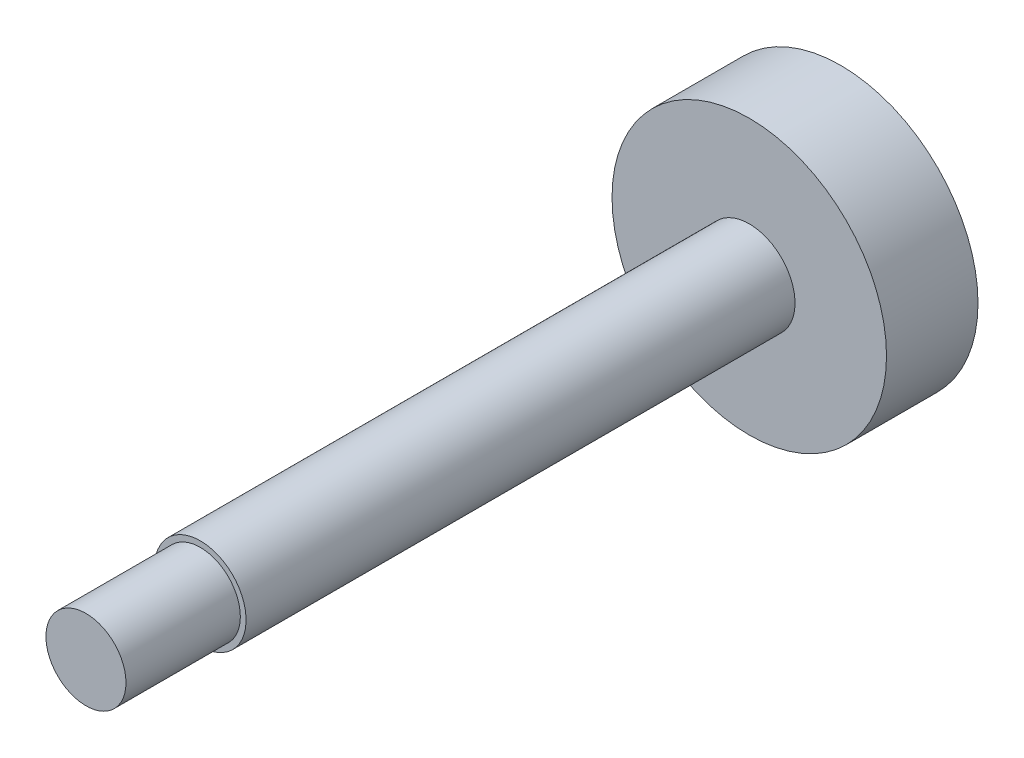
ISO-10303-21;
HEADER;
FILE_DESCRIPTION(('STEP AP214'),'2;1');
FILE_NAME('part.step','',(''),(''),'','','');
FILE_SCHEMA(('AUTOMOTIVE_DESIGN { 1 0 10303 214 1 1 1 1 }'));
ENDSEC;
DATA;
#1=APPLICATION_CONTEXT('core data for automotive mechanical design processes');
#2=APPLICATION_PROTOCOL_DEFINITION('international standard','automotive_design',2000,#1);
#3=PRODUCT_CONTEXT('',#1,'mechanical');
#4=PRODUCT('Part','Part','',(#3));
#5=PRODUCT_RELATED_PRODUCT_CATEGORY('part','',(#4));
#6=PRODUCT_DEFINITION_FORMATION('','',#4);
#7=PRODUCT_DEFINITION_CONTEXT('part definition',#1,'design');
#8=PRODUCT_DEFINITION('design','',#6,#7);
#9=PRODUCT_DEFINITION_SHAPE('','',#8);
#10=(LENGTH_UNIT() NAMED_UNIT(*) SI_UNIT(.MILLI.,.METRE.));
#11=(NAMED_UNIT(*) PLANE_ANGLE_UNIT() SI_UNIT($,.RADIAN.));
#12=(NAMED_UNIT(*) SI_UNIT($,.STERADIAN.) SOLID_ANGLE_UNIT());
#13=UNCERTAINTY_MEASURE_WITH_UNIT(LENGTH_MEASURE(1.E-05),#10,'distance_accuracy_value','');
#14=(GEOMETRIC_REPRESENTATION_CONTEXT(3) GLOBAL_UNCERTAINTY_ASSIGNED_CONTEXT((#13)) GLOBAL_UNIT_ASSIGNED_CONTEXT((#10,
#11,#12)) REPRESENTATION_CONTEXT('',''));
#15=CARTESIAN_POINT('',(0.,0.,0.));
#16=DIRECTION('',(0.,0.,1.));
#17=DIRECTION('',(1.,0.,0.));
#18=AXIS2_PLACEMENT_3D('',#15,#16,#17);
#19=CARTESIAN_POINT('',(0.,0.,177.8));
#20=DIRECTION('',(0.,0.,1.));
#21=DIRECTION('',(1.,0.,0.));
#22=AXIS2_PLACEMENT_3D('',#19,#20,#21);
#23=PLANE('',#22);
#24=CARTESIAN_POINT('',(0.,0.,177.8));
#25=DIRECTION('',(0.,0.,1.));
#26=DIRECTION('',(1.,0.,0.));
#27=AXIS2_PLACEMENT_3D('',#24,#25,#26);
#28=CIRCLE('',#27,12.7);
#29=CARTESIAN_POINT('',(-12.7,0.,177.8));
#30=VERTEX_POINT('',#29);
#31=EDGE_CURVE('E39',#30,#30,#28,.T.);
#32=ORIENTED_EDGE('',*,*,#31,.T.);
#33=EDGE_LOOP('',(#32));
#34=FACE_BOUND('',#33,.T.);
#35=CARTESIAN_POINT('',(0.,0.,177.8));
#36=DIRECTION('',(0.,0.,1.));
#37=DIRECTION('',(1.,0.,0.));
#38=AXIS2_PLACEMENT_3D('',#35,#36,#37);
#39=CIRCLE('',#38,11.1125);
#40=CARTESIAN_POINT('',(11.1125,0.,177.8));
#41=VERTEX_POINT('',#40);
#42=EDGE_CURVE('E47',#41,#41,#39,.T.);
#43=ORIENTED_EDGE('',*,*,#42,.F.);
#44=EDGE_LOOP('',(#43));
#45=FACE_BOUND('',#44,.T.);
#46=ADVANCED_FACE('F28',(#34,#45),#23,.T.);
#47=CARTESIAN_POINT('',(0.,0.,25.4));
#48=DIRECTION('',(0.,0.,1.));
#49=DIRECTION('',(1.,0.,0.));
#50=AXIS2_PLACEMENT_3D('',#47,#48,#49);
#51=PLANE('',#50);
#52=CARTESIAN_POINT('',(0.,0.,25.4));
#53=DIRECTION('',(0.,0.,1.));
#54=DIRECTION('',(1.,0.,0.));
#55=AXIS2_PLACEMENT_3D('',#52,#53,#54);
#56=CIRCLE('',#55,38.1);
#57=CARTESIAN_POINT('',(38.1,0.,25.4));
#58=VERTEX_POINT('',#57);
#59=EDGE_CURVE('E10',#58,#58,#56,.T.);
#60=ORIENTED_EDGE('',*,*,#59,.T.);
#61=EDGE_LOOP('',(#60));
#62=FACE_BOUND('',#61,.T.);
#63=CARTESIAN_POINT('',(0.,0.,25.4));
#64=DIRECTION('',(0.,0.,1.));
#65=DIRECTION('',(1.,0.,0.));
#66=AXIS2_PLACEMENT_3D('',#63,#64,#65);
#67=CIRCLE('',#66,12.7);
#68=CARTESIAN_POINT('',(-12.7,0.,25.4));
#69=VERTEX_POINT('',#68);
#70=EDGE_CURVE('E41',#69,#69,#67,.T.);
#71=ORIENTED_EDGE('',*,*,#70,.F.);
#72=EDGE_LOOP('',(#71));
#73=FACE_BOUND('',#72,.T.);
#74=ADVANCED_FACE('F63',(#62,#73),#51,.T.);
#75=CARTESIAN_POINT('',(0.,0.,25.4));
#76=DIRECTION('',(0.,0.,-1.));
#77=DIRECTION('',(-1.,0.,0.));
#78=AXIS2_PLACEMENT_3D('',#75,#76,#77);
#79=CYLINDRICAL_SURFACE('',#78,38.1);
#80=ORIENTED_EDGE('',*,*,#59,.F.);
#81=EDGE_LOOP('',(#80));
#82=FACE_BOUND('',#81,.T.);
#83=CARTESIAN_POINT('',(0.,0.,0.));
#84=DIRECTION('',(0.,0.,1.));
#85=DIRECTION('',(1.,0.,0.));
#86=AXIS2_PLACEMENT_3D('',#83,#84,#85);
#87=CIRCLE('',#86,38.1);
#88=CARTESIAN_POINT('',(38.1,0.,0.));
#89=VERTEX_POINT('',#88);
#90=EDGE_CURVE('E32',#89,#89,#87,.T.);
#91=ORIENTED_EDGE('',*,*,#90,.T.);
#92=EDGE_LOOP('',(#91));
#93=FACE_BOUND('',#92,.T.);
#94=ADVANCED_FACE('F30',(#82,#93),#79,.T.);
#95=CARTESIAN_POINT('',(0.,0.,0.));
#96=DIRECTION('',(0.,0.,1.));
#97=DIRECTION('',(1.,0.,0.));
#98=AXIS2_PLACEMENT_3D('',#95,#96,#97);
#99=PLANE('',#98);
#100=ORIENTED_EDGE('',*,*,#90,.F.);
#101=EDGE_LOOP('',(#100));
#102=FACE_BOUND('',#101,.T.);
#103=ADVANCED_FACE('F73',(#102),#99,.F.);
#104=CARTESIAN_POINT('',(0.,0.,177.8));
#105=DIRECTION('',(0.,0.,-1.));
#106=DIRECTION('',(-1.,0.,0.));
#107=AXIS2_PLACEMENT_3D('',#104,#105,#106);
#108=CYLINDRICAL_SURFACE('',#107,12.7);
#109=CARTESIAN_POINT('',(-12.7,0.,177.8));
#110=CARTESIAN_POINT('',(-12.7,0.,176.2125));
#111=CARTESIAN_POINT('',(-12.7,0.,174.625));
#112=CARTESIAN_POINT('',(-12.7,0.,171.45));
#113=CARTESIAN_POINT('',(-12.7,0.,169.8625));
#114=CARTESIAN_POINT('',(-12.7,0.,166.6875));
#115=CARTESIAN_POINT('',(-12.7,0.,165.1));
#116=CARTESIAN_POINT('',(-12.7,0.,161.925));
#117=CARTESIAN_POINT('',(-12.7,0.,160.3375));
#118=CARTESIAN_POINT('',(-12.7,0.,157.1625));
#119=CARTESIAN_POINT('',(-12.7,0.,155.575));
#120=CARTESIAN_POINT('',(-12.7,0.,152.4));
#121=CARTESIAN_POINT('',(-12.7,0.,150.8125));
#122=CARTESIAN_POINT('',(-12.7,0.,147.6375));
#123=CARTESIAN_POINT('',(-12.7,0.,146.05));
#124=CARTESIAN_POINT('',(-12.7,0.,142.875));
#125=CARTESIAN_POINT('',(-12.7,0.,141.2875));
#126=CARTESIAN_POINT('',(-12.7,0.,138.1125));
#127=CARTESIAN_POINT('',(-12.7,0.,136.525));
#128=CARTESIAN_POINT('',(-12.7,0.,133.35));
#129=CARTESIAN_POINT('',(-12.7,0.,131.7625));
#130=CARTESIAN_POINT('',(-12.7,0.,128.5875));
#131=CARTESIAN_POINT('',(-12.7,0.,127.));
#132=CARTESIAN_POINT('',(-12.7,0.,123.825));
#133=CARTESIAN_POINT('',(-12.7,0.,122.2375));
#134=CARTESIAN_POINT('',(-12.7,0.,119.0625));
#135=CARTESIAN_POINT('',(-12.7,0.,117.475));
#136=CARTESIAN_POINT('',(-12.7,0.,114.3));
#137=CARTESIAN_POINT('',(-12.7,0.,112.7125));
#138=CARTESIAN_POINT('',(-12.7,0.,109.5375));
#139=CARTESIAN_POINT('',(-12.7,0.,107.95));
#140=CARTESIAN_POINT('',(-12.7,0.,104.775));
#141=CARTESIAN_POINT('',(-12.7,0.,103.1875));
#142=CARTESIAN_POINT('',(-12.7,0.,100.0125));
#143=CARTESIAN_POINT('',(-12.7,0.,98.425));
#144=CARTESIAN_POINT('',(-12.7,0.,95.25));
#145=CARTESIAN_POINT('',(-12.7,0.,93.6625));
#146=CARTESIAN_POINT('',(-12.7,0.,90.4875));
#147=CARTESIAN_POINT('',(-12.7,0.,88.9));
#148=CARTESIAN_POINT('',(-12.7,0.,85.725));
#149=CARTESIAN_POINT('',(-12.7,0.,84.1375));
#150=CARTESIAN_POINT('',(-12.7,0.,80.9625));
#151=CARTESIAN_POINT('',(-12.7,0.,79.375));
#152=CARTESIAN_POINT('',(-12.7,0.,76.2));
#153=CARTESIAN_POINT('',(-12.7,0.,74.6125));
#154=CARTESIAN_POINT('',(-12.7,0.,71.4375));
#155=CARTESIAN_POINT('',(-12.7,0.,69.85));
#156=CARTESIAN_POINT('',(-12.7,0.,66.675));
#157=CARTESIAN_POINT('',(-12.7,0.,65.0875));
#158=CARTESIAN_POINT('',(-12.7,0.,61.9125));
#159=CARTESIAN_POINT('',(-12.7,0.,60.325));
#160=CARTESIAN_POINT('',(-12.7,0.,57.15));
#161=CARTESIAN_POINT('',(-12.7,0.,55.5625));
#162=CARTESIAN_POINT('',(-12.7,0.,52.3875));
#163=CARTESIAN_POINT('',(-12.7,0.,50.8));
#164=CARTESIAN_POINT('',(-12.7,0.,47.625));
#165=CARTESIAN_POINT('',(-12.7,0.,46.0375));
#166=CARTESIAN_POINT('',(-12.7,0.,42.8625));
#167=CARTESIAN_POINT('',(-12.7,0.,41.275));
#168=CARTESIAN_POINT('',(-12.7,0.,38.1));
#169=CARTESIAN_POINT('',(-12.7,0.,36.5125));
#170=CARTESIAN_POINT('',(-12.7,0.,33.3375));
#171=CARTESIAN_POINT('',(-12.7,0.,31.75));
#172=CARTESIAN_POINT('',(-12.7,0.,28.575));
#173=CARTESIAN_POINT('',(-12.7,0.,26.9875));
#174=CARTESIAN_POINT('',(-12.7,0.,25.4));
#175=B_SPLINE_CURVE_WITH_KNOTS('',3,(#109,#110,#111,#112,#113,#114,#115,#116,#117,#118,#119,
#120,#121,#122,#123,#124,#125,#126,#127,#128,#129,#130,#131,#132,#133,#134,#135,#136,#137,#138,
#139,#140,#141,#142,#143,#144,#145,#146,#147,#148,#149,#150,#151,#152,#153,#154,#155,#156,#157,
#158,#159,#160,#161,#162,#163,#164,#165,#166,#167,#168,#169,#170,#171,#172,#173,#174),
.UNSPECIFIED.,.F.,.F.,(4,2,2,2,2,2,2,2,2,2,2,2,2,2,2,2,2,2,2,2,2,2,2,2,2,2,2,2,2,2,2,2,4),(0.,
4.76249999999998,9.52499999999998,14.2875,19.05,23.8125,28.575,33.3375,38.1,42.8625,47.625,
52.3875,57.15,61.9125,66.675,71.4375,76.2,80.9625,85.725,90.4875,95.25,100.0125,104.775,
109.5375,114.3,119.0625,123.825,128.5875,133.35,138.1125,142.875,147.6375,152.4),.UNSPECIFIED.);
#176=EDGE_CURVE('BSEAM58',#30,#69,#175,.T.);
#177=ORIENTED_EDGE('',*,*,#31,.F.);
#178=ORIENTED_EDGE('',*,*,#70,.T.);
#179=ORIENTED_EDGE('',*,*,#176,.T.);
#180=ORIENTED_EDGE('',*,*,#176,.F.);
#181=EDGE_LOOP('',(#177,#179,#178,#180));
#182=FACE_BOUND('',#181,.T.);
#183=ADVANCED_FACE('F58',(#182),#108,.T.);
#184=CARTESIAN_POINT('',(0.,0.,209.55));
#185=DIRECTION('',(0.,0.,-1.));
#186=DIRECTION('',(-1.,0.,0.));
#187=AXIS2_PLACEMENT_3D('',#184,#185,#186);
#188=CYLINDRICAL_SURFACE('',#187,11.1125);
#189=CARTESIAN_POINT('',(0.,0.,209.55));
#190=DIRECTION('',(0.,0.,1.));
#191=DIRECTION('',(1.,0.,0.));
#192=AXIS2_PLACEMENT_3D('',#189,#190,#191);
#193=CIRCLE('',#192,11.1125);
#194=CARTESIAN_POINT('',(11.1125,0.,209.55));
#195=VERTEX_POINT('',#194);
#196=EDGE_CURVE('E44',#195,#195,#193,.T.);
#197=ORIENTED_EDGE('',*,*,#196,.F.);
#198=EDGE_LOOP('',(#197));
#199=FACE_BOUND('',#198,.T.);
#200=ORIENTED_EDGE('',*,*,#42,.T.);
#201=EDGE_LOOP('',(#200));
#202=FACE_BOUND('',#201,.T.);
#203=ADVANCED_FACE('F55',(#199,#202),#188,.T.);
#204=CARTESIAN_POINT('',(0.,0.,209.55));
#205=DIRECTION('',(0.,0.,1.));
#206=DIRECTION('',(1.,0.,0.));
#207=AXIS2_PLACEMENT_3D('',#204,#205,#206);
#208=PLANE('',#207);
#209=ORIENTED_EDGE('',*,*,#196,.T.);
#210=EDGE_LOOP('',(#209));
#211=FACE_BOUND('',#210,.T.);
#212=ADVANCED_FACE('F53',(#211),#208,.T.);
#213=CLOSED_SHELL('',(#46,#74,#94,#103,#183,#203,#212));
#214=MANIFOLD_SOLID_BREP('B2',#213);
#215=ADVANCED_BREP_SHAPE_REPRESENTATION('',(#18,#214),#14);
#216=SHAPE_DEFINITION_REPRESENTATION(#9,#215);
ENDSEC;
END-ISO-10303-21;
